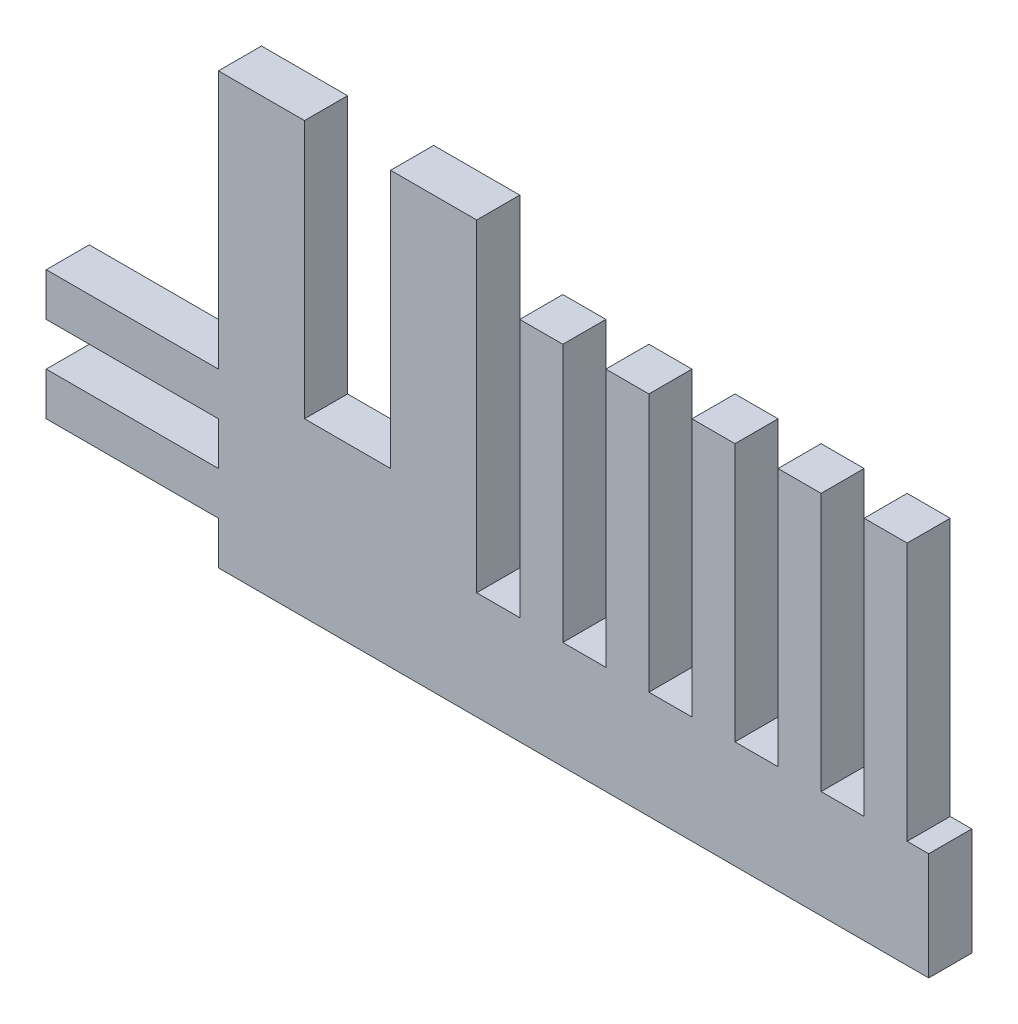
ISO-10303-21;
HEADER;
FILE_DESCRIPTION(('STEP AP214'),'2;1');
FILE_NAME('part.step','',(''),(''),'','','');
FILE_SCHEMA(('AUTOMOTIVE_DESIGN { 1 0 10303 214 1 1 1 1 }'));
ENDSEC;
DATA;
#1=APPLICATION_CONTEXT('core data for automotive mechanical design processes');
#2=APPLICATION_PROTOCOL_DEFINITION('international standard','automotive_design',2000,#1);
#3=PRODUCT_CONTEXT('',#1,'mechanical');
#4=PRODUCT('Part','Part','',(#3));
#5=PRODUCT_RELATED_PRODUCT_CATEGORY('part','',(#4));
#6=PRODUCT_DEFINITION_FORMATION('','',#4);
#7=PRODUCT_DEFINITION_CONTEXT('part definition',#1,'design');
#8=PRODUCT_DEFINITION('design','',#6,#7);
#9=PRODUCT_DEFINITION_SHAPE('','',#8);
#10=(LENGTH_UNIT() NAMED_UNIT(*) SI_UNIT(.MILLI.,.METRE.));
#11=(NAMED_UNIT(*) PLANE_ANGLE_UNIT() SI_UNIT($,.RADIAN.));
#12=(NAMED_UNIT(*) SI_UNIT($,.STERADIAN.) SOLID_ANGLE_UNIT());
#13=UNCERTAINTY_MEASURE_WITH_UNIT(LENGTH_MEASURE(1.E-05),#10,'distance_accuracy_value','');
#14=(GEOMETRIC_REPRESENTATION_CONTEXT(3) GLOBAL_UNCERTAINTY_ASSIGNED_CONTEXT((#13)) GLOBAL_UNIT_ASSIGNED_CONTEXT((#10,
#11,#12)) REPRESENTATION_CONTEXT('',''));
#15=CARTESIAN_POINT('',(0.,0.,0.));
#16=DIRECTION('',(0.,0.,1.));
#17=DIRECTION('',(1.,0.,0.));
#18=AXIS2_PLACEMENT_3D('',#15,#16,#17);
#19=CARTESIAN_POINT('',(16.5,0.,1.));
#20=DIRECTION('',(0.,1.,0.));
#21=DIRECTION('',(-1.,0.,0.));
#22=AXIS2_PLACEMENT_3D('',#19,#20,#21);
#23=PLANE('',#22);
#24=DIRECTION('',(1.,0.,0.));
#25=VECTOR('',#24,1.);
#26=CARTESIAN_POINT('',(16.5,0.,0.));
#27=LINE('',#26,#25);
#28=CARTESIAN_POINT('',(0.,0.,0.));
#29=VERTEX_POINT('',#28);
#30=CARTESIAN_POINT('',(16.5,0.,0.));
#31=VERTEX_POINT('',#30);
#32=EDGE_CURVE('E309',#29,#31,#27,.T.);
#33=ORIENTED_EDGE('',*,*,#32,.T.);
#34=DIRECTION('',(0.,0.,-1.));
#35=VECTOR('',#34,1.);
#36=CARTESIAN_POINT('',(16.5,0.,1.));
#37=LINE('',#36,#35);
#38=CARTESIAN_POINT('',(16.5,0.,1.));
#39=VERTEX_POINT('',#38);
#40=EDGE_CURVE('E11',#39,#31,#37,.T.);
#41=ORIENTED_EDGE('',*,*,#40,.F.);
#42=DIRECTION('',(1.,0.,0.));
#43=VECTOR('',#42,1.);
#44=CARTESIAN_POINT('',(16.5,0.,1.));
#45=LINE('',#44,#43);
#46=CARTESIAN_POINT('',(0.,0.,1.));
#47=VERTEX_POINT('',#46);
#48=EDGE_CURVE('E388',#47,#39,#45,.T.);
#49=ORIENTED_EDGE('',*,*,#48,.F.);
#50=DIRECTION('',(0.,0.,-1.));
#51=VECTOR('',#50,1.);
#52=CARTESIAN_POINT('',(0.,0.,1.));
#53=LINE('',#52,#51);
#54=EDGE_CURVE('E305',#47,#29,#53,.T.);
#55=ORIENTED_EDGE('',*,*,#54,.T.);
#56=EDGE_LOOP('',(#33,#41,#49,#55));
#57=FACE_BOUND('',#56,.T.);
#58=ADVANCED_FACE('F33',(#57),#23,.F.);
#59=CARTESIAN_POINT('',(16.5,0.,1.));
#60=DIRECTION('',(-1.,0.,0.));
#61=DIRECTION('',(0.,-1.,0.));
#62=AXIS2_PLACEMENT_3D('',#59,#60,#61);
#63=PLANE('',#62);
#64=DIRECTION('',(0.,1.,0.));
#65=VECTOR('',#64,1.);
#66=CARTESIAN_POINT('',(16.5,0.,0.));
#67=LINE('',#66,#65);
#68=CARTESIAN_POINT('',(16.5,2.5,0.));
#69=VERTEX_POINT('',#68);
#70=EDGE_CURVE('E312',#31,#69,#67,.T.);
#71=ORIENTED_EDGE('',*,*,#70,.T.);
#72=DIRECTION('',(0.,0.,-1.));
#73=VECTOR('',#72,1.);
#74=CARTESIAN_POINT('',(16.5,2.5,1.));
#75=LINE('',#74,#73);
#76=CARTESIAN_POINT('',(16.5,2.5,1.));
#77=VERTEX_POINT('',#76);
#78=EDGE_CURVE('E41',#77,#69,#75,.T.);
#79=ORIENTED_EDGE('',*,*,#78,.F.);
#80=DIRECTION('',(0.,1.,0.));
#81=VECTOR('',#80,1.);
#82=CARTESIAN_POINT('',(16.5,0.,1.));
#83=LINE('',#82,#81);
#84=EDGE_CURVE('E182',#39,#77,#83,.T.);
#85=ORIENTED_EDGE('',*,*,#84,.F.);
#86=ORIENTED_EDGE('',*,*,#40,.T.);
#87=EDGE_LOOP('',(#71,#79,#85,#86));
#88=FACE_BOUND('',#87,.T.);
#89=ADVANCED_FACE('F596',(#88),#63,.F.);
#90=CARTESIAN_POINT('',(16.,2.5,1.));
#91=DIRECTION('',(0.,-1.,0.));
#92=DIRECTION('',(0.,0.,-1.));
#93=AXIS2_PLACEMENT_3D('',#90,#91,#92);
#94=PLANE('',#93);
#95=DIRECTION('',(-1.,0.,0.));
#96=VECTOR('',#95,1.);
#97=CARTESIAN_POINT('',(16.,2.5,0.));
#98=LINE('',#97,#96);
#99=CARTESIAN_POINT('',(16.,2.5,0.));
#100=VERTEX_POINT('',#99);
#101=EDGE_CURVE('E314',#69,#100,#98,.T.);
#102=ORIENTED_EDGE('',*,*,#101,.T.);
#103=DIRECTION('',(0.,0.,-1.));
#104=VECTOR('',#103,1.);
#105=CARTESIAN_POINT('',(16.,2.5,1.));
#106=LINE('',#105,#104);
#107=CARTESIAN_POINT('',(16.,2.5,1.));
#108=VERTEX_POINT('',#107);
#109=EDGE_CURVE('E485',#108,#100,#106,.T.);
#110=ORIENTED_EDGE('',*,*,#109,.F.);
#111=DIRECTION('',(-1.,0.,0.));
#112=VECTOR('',#111,1.);
#113=CARTESIAN_POINT('',(16.,2.5,1.));
#114=LINE('',#113,#112);
#115=EDGE_CURVE('E493',#77,#108,#114,.T.);
#116=ORIENTED_EDGE('',*,*,#115,.F.);
#117=ORIENTED_EDGE('',*,*,#78,.T.);
#118=EDGE_LOOP('',(#102,#110,#116,#117));
#119=FACE_BOUND('',#118,.T.);
#120=ADVANCED_FACE('F491',(#119),#94,.F.);
#121=CARTESIAN_POINT('',(16.,8.5,1.));
#122=DIRECTION('',(-1.,0.,0.));
#123=DIRECTION('',(0.,-1.,0.));
#124=AXIS2_PLACEMENT_3D('',#121,#122,#123);
#125=PLANE('',#124);
#126=DIRECTION('',(0.,1.,0.));
#127=VECTOR('',#126,1.);
#128=CARTESIAN_POINT('',(16.,8.5,0.));
#129=LINE('',#128,#127);
#130=CARTESIAN_POINT('',(16.,8.5,0.));
#131=VERTEX_POINT('',#130);
#132=EDGE_CURVE('E316',#100,#131,#129,.T.);
#133=ORIENTED_EDGE('',*,*,#132,.T.);
#134=DIRECTION('',(0.,0.,-1.));
#135=VECTOR('',#134,1.);
#136=CARTESIAN_POINT('',(16.,8.5,1.));
#137=LINE('',#136,#135);
#138=CARTESIAN_POINT('',(16.,8.5,1.));
#139=VERTEX_POINT('',#138);
#140=EDGE_CURVE('E482',#139,#131,#137,.T.);
#141=ORIENTED_EDGE('',*,*,#140,.F.);
#142=DIRECTION('',(0.,1.,0.));
#143=VECTOR('',#142,1.);
#144=CARTESIAN_POINT('',(16.,8.5,1.));
#145=LINE('',#144,#143);
#146=EDGE_CURVE('E511',#108,#139,#145,.T.);
#147=ORIENTED_EDGE('',*,*,#146,.F.);
#148=ORIENTED_EDGE('',*,*,#109,.T.);
#149=EDGE_LOOP('',(#133,#141,#147,#148));
#150=FACE_BOUND('',#149,.T.);
#151=ADVANCED_FACE('F502',(#150),#125,.F.);
#152=CARTESIAN_POINT('',(15.,8.5,1.));
#153=DIRECTION('',(0.,-1.,0.));
#154=DIRECTION('',(0.,0.,-1.));
#155=AXIS2_PLACEMENT_3D('',#152,#153,#154);
#156=PLANE('',#155);
#157=DIRECTION('',(-1.,0.,0.));
#158=VECTOR('',#157,1.);
#159=CARTESIAN_POINT('',(15.,8.5,0.));
#160=LINE('',#159,#158);
#161=CARTESIAN_POINT('',(15.,8.5,0.));
#162=VERTEX_POINT('',#161);
#163=EDGE_CURVE('E318',#131,#162,#160,.T.);
#164=ORIENTED_EDGE('',*,*,#163,.T.);
#165=DIRECTION('',(0.,0.,-1.));
#166=VECTOR('',#165,1.);
#167=CARTESIAN_POINT('',(15.,8.5,1.));
#168=LINE('',#167,#166);
#169=CARTESIAN_POINT('',(15.,8.5,1.));
#170=VERTEX_POINT('',#169);
#171=EDGE_CURVE('E479',#170,#162,#168,.T.);
#172=ORIENTED_EDGE('',*,*,#171,.F.);
#173=DIRECTION('',(-1.,0.,0.));
#174=VECTOR('',#173,1.);
#175=CARTESIAN_POINT('',(15.,8.5,1.));
#176=LINE('',#175,#174);
#177=EDGE_CURVE('E508',#139,#170,#176,.T.);
#178=ORIENTED_EDGE('',*,*,#177,.F.);
#179=ORIENTED_EDGE('',*,*,#140,.T.);
#180=EDGE_LOOP('',(#164,#172,#178,#179));
#181=FACE_BOUND('',#180,.T.);
#182=ADVANCED_FACE('F506',(#181),#156,.F.);
#183=CARTESIAN_POINT('',(15.,2.5,1.));
#184=DIRECTION('',(1.,0.,0.));
#185=DIRECTION('',(0.,0.,-1.));
#186=AXIS2_PLACEMENT_3D('',#183,#184,#185);
#187=PLANE('',#186);
#188=DIRECTION('',(0.,-1.,0.));
#189=VECTOR('',#188,1.);
#190=CARTESIAN_POINT('',(15.,2.5,0.));
#191=LINE('',#190,#189);
#192=CARTESIAN_POINT('',(15.,2.5,0.));
#193=VERTEX_POINT('',#192);
#194=EDGE_CURVE('E320',#162,#193,#191,.T.);
#195=ORIENTED_EDGE('',*,*,#194,.T.);
#196=DIRECTION('',(0.,0.,-1.));
#197=VECTOR('',#196,1.);
#198=CARTESIAN_POINT('',(15.,2.5,1.));
#199=LINE('',#198,#197);
#200=CARTESIAN_POINT('',(15.,2.5,1.));
#201=VERTEX_POINT('',#200);
#202=EDGE_CURVE('E476',#201,#193,#199,.T.);
#203=ORIENTED_EDGE('',*,*,#202,.F.);
#204=DIRECTION('',(0.,-1.,0.));
#205=VECTOR('',#204,1.);
#206=CARTESIAN_POINT('',(15.,2.5,1.));
#207=LINE('',#206,#205);
#208=EDGE_CURVE('E510',#170,#201,#207,.T.);
#209=ORIENTED_EDGE('',*,*,#208,.F.);
#210=ORIENTED_EDGE('',*,*,#171,.T.);
#211=EDGE_LOOP('',(#195,#203,#209,#210));
#212=FACE_BOUND('',#211,.T.);
#213=ADVANCED_FACE('F609',(#212),#187,.F.);
#214=CARTESIAN_POINT('',(14.,2.5,1.));
#215=DIRECTION('',(0.,-1.,0.));
#216=DIRECTION('',(0.,0.,-1.));
#217=AXIS2_PLACEMENT_3D('',#214,#215,#216);
#218=PLANE('',#217);
#219=DIRECTION('',(-1.,0.,0.));
#220=VECTOR('',#219,1.);
#221=CARTESIAN_POINT('',(14.,2.5,0.));
#222=LINE('',#221,#220);
#223=CARTESIAN_POINT('',(14.,2.5,0.));
#224=VERTEX_POINT('',#223);
#225=EDGE_CURVE('E323',#193,#224,#222,.T.);
#226=ORIENTED_EDGE('',*,*,#225,.T.);
#227=DIRECTION('',(0.,0.,-1.));
#228=VECTOR('',#227,1.);
#229=CARTESIAN_POINT('',(14.,2.5,1.));
#230=LINE('',#229,#228);
#231=CARTESIAN_POINT('',(14.,2.5,1.));
#232=VERTEX_POINT('',#231);
#233=EDGE_CURVE('E473',#232,#224,#230,.T.);
#234=ORIENTED_EDGE('',*,*,#233,.F.);
#235=DIRECTION('',(-1.,0.,0.));
#236=VECTOR('',#235,1.);
#237=CARTESIAN_POINT('',(14.5,2.5,1.));
#238=LINE('',#237,#236);
#239=EDGE_CURVE('E513',#201,#232,#238,.T.);
#240=ORIENTED_EDGE('',*,*,#239,.F.);
#241=ORIENTED_EDGE('',*,*,#202,.T.);
#242=EDGE_LOOP('',(#226,#234,#240,#241));
#243=FACE_BOUND('',#242,.T.);
#244=ADVANCED_FACE('F612',(#243),#218,.F.);
#245=CARTESIAN_POINT('',(14.,8.5,1.));
#246=DIRECTION('',(-1.,0.,0.));
#247=DIRECTION('',(0.,-1.,0.));
#248=AXIS2_PLACEMENT_3D('',#245,#246,#247);
#249=PLANE('',#248);
#250=DIRECTION('',(0.,1.,0.));
#251=VECTOR('',#250,1.);
#252=CARTESIAN_POINT('',(14.,8.5,0.));
#253=LINE('',#252,#251);
#254=CARTESIAN_POINT('',(14.,8.5,0.));
#255=VERTEX_POINT('',#254);
#256=EDGE_CURVE('E325',#224,#255,#253,.T.);
#257=ORIENTED_EDGE('',*,*,#256,.T.);
#258=DIRECTION('',(0.,0.,-1.));
#259=VECTOR('',#258,1.);
#260=CARTESIAN_POINT('',(14.,8.5,1.));
#261=LINE('',#260,#259);
#262=CARTESIAN_POINT('',(14.,8.5,1.));
#263=VERTEX_POINT('',#262);
#264=EDGE_CURVE('E470',#263,#255,#261,.T.);
#265=ORIENTED_EDGE('',*,*,#264,.F.);
#266=DIRECTION('',(0.,1.,0.));
#267=VECTOR('',#266,1.);
#268=CARTESIAN_POINT('',(14.,8.5,1.));
#269=LINE('',#268,#267);
#270=EDGE_CURVE('E519',#232,#263,#269,.T.);
#271=ORIENTED_EDGE('',*,*,#270,.F.);
#272=ORIENTED_EDGE('',*,*,#233,.T.);
#273=EDGE_LOOP('',(#257,#265,#271,#272));
#274=FACE_BOUND('',#273,.T.);
#275=ADVANCED_FACE('F616',(#274),#249,.F.);
#276=CARTESIAN_POINT('',(13.,8.5,1.));
#277=DIRECTION('',(0.,-1.,0.));
#278=DIRECTION('',(0.,0.,-1.));
#279=AXIS2_PLACEMENT_3D('',#276,#277,#278);
#280=PLANE('',#279);
#281=DIRECTION('',(-1.,0.,0.));
#282=VECTOR('',#281,1.);
#283=CARTESIAN_POINT('',(13.,8.5,0.));
#284=LINE('',#283,#282);
#285=CARTESIAN_POINT('',(13.,8.5,0.));
#286=VERTEX_POINT('',#285);
#287=EDGE_CURVE('E327',#255,#286,#284,.T.);
#288=ORIENTED_EDGE('',*,*,#287,.T.);
#289=DIRECTION('',(0.,0.,-1.));
#290=VECTOR('',#289,1.);
#291=CARTESIAN_POINT('',(13.,8.5,1.));
#292=LINE('',#291,#290);
#293=CARTESIAN_POINT('',(13.,8.5,1.));
#294=VERTEX_POINT('',#293);
#295=EDGE_CURVE('E467',#294,#286,#292,.T.);
#296=ORIENTED_EDGE('',*,*,#295,.F.);
#297=DIRECTION('',(-1.,0.,0.));
#298=VECTOR('',#297,1.);
#299=CARTESIAN_POINT('',(13.,8.5,1.));
#300=LINE('',#299,#298);
#301=EDGE_CURVE('E521',#263,#294,#300,.T.);
#302=ORIENTED_EDGE('',*,*,#301,.F.);
#303=ORIENTED_EDGE('',*,*,#264,.T.);
#304=EDGE_LOOP('',(#288,#296,#302,#303));
#305=FACE_BOUND('',#304,.T.);
#306=ADVANCED_FACE('F620',(#305),#280,.F.);
#307=CARTESIAN_POINT('',(13.,2.5,1.));
#308=DIRECTION('',(1.,0.,0.));
#309=DIRECTION('',(0.,0.,-1.));
#310=AXIS2_PLACEMENT_3D('',#307,#308,#309);
#311=PLANE('',#310);
#312=DIRECTION('',(0.,-1.,0.));
#313=VECTOR('',#312,1.);
#314=CARTESIAN_POINT('',(13.,2.5,0.));
#315=LINE('',#314,#313);
#316=CARTESIAN_POINT('',(13.,2.5,0.));
#317=VERTEX_POINT('',#316);
#318=EDGE_CURVE('E329',#286,#317,#315,.T.);
#319=ORIENTED_EDGE('',*,*,#318,.T.);
#320=DIRECTION('',(0.,0.,-1.));
#321=VECTOR('',#320,1.);
#322=CARTESIAN_POINT('',(13.,2.5,1.));
#323=LINE('',#322,#321);
#324=CARTESIAN_POINT('',(13.,2.5,1.));
#325=VERTEX_POINT('',#324);
#326=EDGE_CURVE('E464',#325,#317,#323,.T.);
#327=ORIENTED_EDGE('',*,*,#326,.F.);
#328=DIRECTION('',(0.,-1.,0.));
#329=VECTOR('',#328,1.);
#330=CARTESIAN_POINT('',(13.,2.5,1.));
#331=LINE('',#330,#329);
#332=EDGE_CURVE('E523',#294,#325,#331,.T.);
#333=ORIENTED_EDGE('',*,*,#332,.F.);
#334=ORIENTED_EDGE('',*,*,#295,.T.);
#335=EDGE_LOOP('',(#319,#327,#333,#334));
#336=FACE_BOUND('',#335,.T.);
#337=ADVANCED_FACE('F624',(#336),#311,.F.);
#338=CARTESIAN_POINT('',(12.,2.5,1.));
#339=DIRECTION('',(0.,-1.,0.));
#340=DIRECTION('',(0.,0.,-1.));
#341=AXIS2_PLACEMENT_3D('',#338,#339,#340);
#342=PLANE('',#341);
#343=DIRECTION('',(-1.,0.,0.));
#344=VECTOR('',#343,1.);
#345=CARTESIAN_POINT('',(12.,2.5,0.));
#346=LINE('',#345,#344);
#347=CARTESIAN_POINT('',(12.,2.5,0.));
#348=VERTEX_POINT('',#347);
#349=EDGE_CURVE('E332',#317,#348,#346,.T.);
#350=ORIENTED_EDGE('',*,*,#349,.T.);
#351=DIRECTION('',(0.,0.,-1.));
#352=VECTOR('',#351,1.);
#353=CARTESIAN_POINT('',(12.,2.5,1.));
#354=LINE('',#353,#352);
#355=CARTESIAN_POINT('',(12.,2.5,1.));
#356=VERTEX_POINT('',#355);
#357=EDGE_CURVE('E461',#356,#348,#354,.T.);
#358=ORIENTED_EDGE('',*,*,#357,.F.);
#359=DIRECTION('',(-1.,0.,0.));
#360=VECTOR('',#359,1.);
#361=CARTESIAN_POINT('',(12.5,2.5,1.));
#362=LINE('',#361,#360);
#363=EDGE_CURVE('E525',#325,#356,#362,.T.);
#364=ORIENTED_EDGE('',*,*,#363,.F.);
#365=ORIENTED_EDGE('',*,*,#326,.T.);
#366=EDGE_LOOP('',(#350,#358,#364,#365));
#367=FACE_BOUND('',#366,.T.);
#368=ADVANCED_FACE('F628',(#367),#342,.F.);
#369=CARTESIAN_POINT('',(12.,8.5,1.));
#370=DIRECTION('',(-1.,0.,0.));
#371=DIRECTION('',(0.,-1.,0.));
#372=AXIS2_PLACEMENT_3D('',#369,#370,#371);
#373=PLANE('',#372);
#374=DIRECTION('',(0.,1.,0.));
#375=VECTOR('',#374,1.);
#376=CARTESIAN_POINT('',(12.,8.5,0.));
#377=LINE('',#376,#375);
#378=CARTESIAN_POINT('',(12.,8.5,0.));
#379=VERTEX_POINT('',#378);
#380=EDGE_CURVE('E334',#348,#379,#377,.T.);
#381=ORIENTED_EDGE('',*,*,#380,.T.);
#382=DIRECTION('',(0.,0.,-1.));
#383=VECTOR('',#382,1.);
#384=CARTESIAN_POINT('',(12.,8.5,1.));
#385=LINE('',#384,#383);
#386=CARTESIAN_POINT('',(12.,8.5,1.));
#387=VERTEX_POINT('',#386);
#388=EDGE_CURVE('E458',#387,#379,#385,.T.);
#389=ORIENTED_EDGE('',*,*,#388,.F.);
#390=DIRECTION('',(0.,1.,0.));
#391=VECTOR('',#390,1.);
#392=CARTESIAN_POINT('',(12.,8.5,1.));
#393=LINE('',#392,#391);
#394=EDGE_CURVE('E527',#356,#387,#393,.T.);
#395=ORIENTED_EDGE('',*,*,#394,.F.);
#396=ORIENTED_EDGE('',*,*,#357,.T.);
#397=EDGE_LOOP('',(#381,#389,#395,#396));
#398=FACE_BOUND('',#397,.T.);
#399=ADVANCED_FACE('F632',(#398),#373,.F.);
#400=CARTESIAN_POINT('',(11.,8.5,1.));
#401=DIRECTION('',(0.,-1.,0.));
#402=DIRECTION('',(0.,0.,-1.));
#403=AXIS2_PLACEMENT_3D('',#400,#401,#402);
#404=PLANE('',#403);
#405=DIRECTION('',(-1.,0.,0.));
#406=VECTOR('',#405,1.);
#407=CARTESIAN_POINT('',(11.,8.5,0.));
#408=LINE('',#407,#406);
#409=CARTESIAN_POINT('',(11.,8.5,0.));
#410=VERTEX_POINT('',#409);
#411=EDGE_CURVE('E336',#379,#410,#408,.T.);
#412=ORIENTED_EDGE('',*,*,#411,.T.);
#413=DIRECTION('',(0.,0.,-1.));
#414=VECTOR('',#413,1.);
#415=CARTESIAN_POINT('',(11.,8.5,1.));
#416=LINE('',#415,#414);
#417=CARTESIAN_POINT('',(11.,8.5,1.));
#418=VERTEX_POINT('',#417);
#419=EDGE_CURVE('E455',#418,#410,#416,.T.);
#420=ORIENTED_EDGE('',*,*,#419,.F.);
#421=DIRECTION('',(-1.,0.,0.));
#422=VECTOR('',#421,1.);
#423=CARTESIAN_POINT('',(11.,8.5,1.));
#424=LINE('',#423,#422);
#425=EDGE_CURVE('E529',#387,#418,#424,.T.);
#426=ORIENTED_EDGE('',*,*,#425,.F.);
#427=ORIENTED_EDGE('',*,*,#388,.T.);
#428=EDGE_LOOP('',(#412,#420,#426,#427));
#429=FACE_BOUND('',#428,.T.);
#430=ADVANCED_FACE('F636',(#429),#404,.F.);
#431=CARTESIAN_POINT('',(11.,2.5,1.));
#432=DIRECTION('',(1.,0.,0.));
#433=DIRECTION('',(0.,0.,-1.));
#434=AXIS2_PLACEMENT_3D('',#431,#432,#433);
#435=PLANE('',#434);
#436=DIRECTION('',(0.,-1.,0.));
#437=VECTOR('',#436,1.);
#438=CARTESIAN_POINT('',(11.,2.5,0.));
#439=LINE('',#438,#437);
#440=CARTESIAN_POINT('',(11.,2.5,0.));
#441=VERTEX_POINT('',#440);
#442=EDGE_CURVE('E338',#410,#441,#439,.T.);
#443=ORIENTED_EDGE('',*,*,#442,.T.);
#444=DIRECTION('',(0.,0.,-1.));
#445=VECTOR('',#444,1.);
#446=CARTESIAN_POINT('',(11.,2.5,1.));
#447=LINE('',#446,#445);
#448=CARTESIAN_POINT('',(11.,2.5,1.));
#449=VERTEX_POINT('',#448);
#450=EDGE_CURVE('E452',#449,#441,#447,.T.);
#451=ORIENTED_EDGE('',*,*,#450,.F.);
#452=DIRECTION('',(0.,-1.,0.));
#453=VECTOR('',#452,1.);
#454=CARTESIAN_POINT('',(11.,2.5,1.));
#455=LINE('',#454,#453);
#456=EDGE_CURVE('E531',#418,#449,#455,.T.);
#457=ORIENTED_EDGE('',*,*,#456,.F.);
#458=ORIENTED_EDGE('',*,*,#419,.T.);
#459=EDGE_LOOP('',(#443,#451,#457,#458));
#460=FACE_BOUND('',#459,.T.);
#461=ADVANCED_FACE('F640',(#460),#435,.F.);
#462=CARTESIAN_POINT('',(10.,2.5,1.));
#463=DIRECTION('',(0.,-1.,0.));
#464=DIRECTION('',(0.,0.,-1.));
#465=AXIS2_PLACEMENT_3D('',#462,#463,#464);
#466=PLANE('',#465);
#467=DIRECTION('',(-1.,0.,0.));
#468=VECTOR('',#467,1.);
#469=CARTESIAN_POINT('',(10.,2.5,0.));
#470=LINE('',#469,#468);
#471=CARTESIAN_POINT('',(10.,2.5,0.));
#472=VERTEX_POINT('',#471);
#473=EDGE_CURVE('E341',#441,#472,#470,.T.);
#474=ORIENTED_EDGE('',*,*,#473,.T.);
#475=DIRECTION('',(0.,0.,-1.));
#476=VECTOR('',#475,1.);
#477=CARTESIAN_POINT('',(10.,2.5,1.));
#478=LINE('',#477,#476);
#479=CARTESIAN_POINT('',(10.,2.5,1.));
#480=VERTEX_POINT('',#479);
#481=EDGE_CURVE('E449',#480,#472,#478,.T.);
#482=ORIENTED_EDGE('',*,*,#481,.F.);
#483=DIRECTION('',(-1.,0.,0.));
#484=VECTOR('',#483,1.);
#485=CARTESIAN_POINT('',(10.5,2.5,1.));
#486=LINE('',#485,#484);
#487=EDGE_CURVE('E533',#449,#480,#486,.T.);
#488=ORIENTED_EDGE('',*,*,#487,.F.);
#489=ORIENTED_EDGE('',*,*,#450,.T.);
#490=EDGE_LOOP('',(#474,#482,#488,#489));
#491=FACE_BOUND('',#490,.T.);
#492=ADVANCED_FACE('F644',(#491),#466,.F.);
#493=CARTESIAN_POINT('',(10.,8.5,1.));
#494=DIRECTION('',(-1.,0.,0.));
#495=DIRECTION('',(0.,-1.,0.));
#496=AXIS2_PLACEMENT_3D('',#493,#494,#495);
#497=PLANE('',#496);
#498=DIRECTION('',(0.,1.,0.));
#499=VECTOR('',#498,1.);
#500=CARTESIAN_POINT('',(10.,8.5,0.));
#501=LINE('',#500,#499);
#502=CARTESIAN_POINT('',(10.,8.5,0.));
#503=VERTEX_POINT('',#502);
#504=EDGE_CURVE('E343',#472,#503,#501,.T.);
#505=ORIENTED_EDGE('',*,*,#504,.T.);
#506=DIRECTION('',(0.,0.,-1.));
#507=VECTOR('',#506,1.);
#508=CARTESIAN_POINT('',(10.,8.5,1.));
#509=LINE('',#508,#507);
#510=CARTESIAN_POINT('',(10.,8.5,1.));
#511=VERTEX_POINT('',#510);
#512=EDGE_CURVE('E446',#511,#503,#509,.T.);
#513=ORIENTED_EDGE('',*,*,#512,.F.);
#514=DIRECTION('',(0.,1.,0.));
#515=VECTOR('',#514,1.);
#516=CARTESIAN_POINT('',(10.,8.5,1.));
#517=LINE('',#516,#515);
#518=EDGE_CURVE('E535',#480,#511,#517,.T.);
#519=ORIENTED_EDGE('',*,*,#518,.F.);
#520=ORIENTED_EDGE('',*,*,#481,.T.);
#521=EDGE_LOOP('',(#505,#513,#519,#520));
#522=FACE_BOUND('',#521,.T.);
#523=ADVANCED_FACE('F648',(#522),#497,.F.);
#524=CARTESIAN_POINT('',(9.,8.5,1.));
#525=DIRECTION('',(0.,-1.,0.));
#526=DIRECTION('',(0.,0.,-1.));
#527=AXIS2_PLACEMENT_3D('',#524,#525,#526);
#528=PLANE('',#527);
#529=DIRECTION('',(-1.,0.,0.));
#530=VECTOR('',#529,1.);
#531=CARTESIAN_POINT('',(9.,8.5,0.));
#532=LINE('',#531,#530);
#533=CARTESIAN_POINT('',(9.,8.5,0.));
#534=VERTEX_POINT('',#533);
#535=EDGE_CURVE('E345',#503,#534,#532,.T.);
#536=ORIENTED_EDGE('',*,*,#535,.T.);
#537=DIRECTION('',(0.,0.,-1.));
#538=VECTOR('',#537,1.);
#539=CARTESIAN_POINT('',(9.,8.5,1.));
#540=LINE('',#539,#538);
#541=CARTESIAN_POINT('',(9.,8.5,1.));
#542=VERTEX_POINT('',#541);
#543=EDGE_CURVE('E443',#542,#534,#540,.T.);
#544=ORIENTED_EDGE('',*,*,#543,.F.);
#545=DIRECTION('',(-1.,0.,0.));
#546=VECTOR('',#545,1.);
#547=CARTESIAN_POINT('',(9.,8.5,1.));
#548=LINE('',#547,#546);
#549=EDGE_CURVE('E537',#511,#542,#548,.T.);
#550=ORIENTED_EDGE('',*,*,#549,.F.);
#551=ORIENTED_EDGE('',*,*,#512,.T.);
#552=EDGE_LOOP('',(#536,#544,#550,#551));
#553=FACE_BOUND('',#552,.T.);
#554=ADVANCED_FACE('F652',(#553),#528,.F.);
#555=CARTESIAN_POINT('',(9.,2.5,1.));
#556=DIRECTION('',(1.,0.,0.));
#557=DIRECTION('',(0.,0.,-1.));
#558=AXIS2_PLACEMENT_3D('',#555,#556,#557);
#559=PLANE('',#558);
#560=DIRECTION('',(0.,-1.,0.));
#561=VECTOR('',#560,1.);
#562=CARTESIAN_POINT('',(9.,2.5,0.));
#563=LINE('',#562,#561);
#564=CARTESIAN_POINT('',(9.,2.5,0.));
#565=VERTEX_POINT('',#564);
#566=EDGE_CURVE('E347',#534,#565,#563,.T.);
#567=ORIENTED_EDGE('',*,*,#566,.T.);
#568=DIRECTION('',(0.,0.,-1.));
#569=VECTOR('',#568,1.);
#570=CARTESIAN_POINT('',(9.,2.5,1.));
#571=LINE('',#570,#569);
#572=CARTESIAN_POINT('',(9.,2.5,1.));
#573=VERTEX_POINT('',#572);
#574=EDGE_CURVE('E440',#573,#565,#571,.T.);
#575=ORIENTED_EDGE('',*,*,#574,.F.);
#576=DIRECTION('',(0.,-1.,0.));
#577=VECTOR('',#576,1.);
#578=CARTESIAN_POINT('',(9.,2.5,1.));
#579=LINE('',#578,#577);
#580=EDGE_CURVE('E539',#542,#573,#579,.T.);
#581=ORIENTED_EDGE('',*,*,#580,.F.);
#582=ORIENTED_EDGE('',*,*,#543,.T.);
#583=EDGE_LOOP('',(#567,#575,#581,#582));
#584=FACE_BOUND('',#583,.T.);
#585=ADVANCED_FACE('F656',(#584),#559,.F.);
#586=CARTESIAN_POINT('',(8.,2.5,1.));
#587=DIRECTION('',(0.,-1.,0.));
#588=DIRECTION('',(0.,0.,-1.));
#589=AXIS2_PLACEMENT_3D('',#586,#587,#588);
#590=PLANE('',#589);
#591=DIRECTION('',(-1.,0.,0.));
#592=VECTOR('',#591,1.);
#593=CARTESIAN_POINT('',(8.,2.5,0.));
#594=LINE('',#593,#592);
#595=CARTESIAN_POINT('',(8.,2.5,0.));
#596=VERTEX_POINT('',#595);
#597=EDGE_CURVE('E350',#565,#596,#594,.T.);
#598=ORIENTED_EDGE('',*,*,#597,.T.);
#599=DIRECTION('',(0.,0.,-1.));
#600=VECTOR('',#599,1.);
#601=CARTESIAN_POINT('',(8.,2.5,1.));
#602=LINE('',#601,#600);
#603=CARTESIAN_POINT('',(8.,2.5,1.));
#604=VERTEX_POINT('',#603);
#605=EDGE_CURVE('E437',#604,#596,#602,.T.);
#606=ORIENTED_EDGE('',*,*,#605,.F.);
#607=DIRECTION('',(-1.,0.,0.));
#608=VECTOR('',#607,1.);
#609=CARTESIAN_POINT('',(8.5,2.5,1.));
#610=LINE('',#609,#608);
#611=EDGE_CURVE('E541',#573,#604,#610,.T.);
#612=ORIENTED_EDGE('',*,*,#611,.F.);
#613=ORIENTED_EDGE('',*,*,#574,.T.);
#614=EDGE_LOOP('',(#598,#606,#612,#613));
#615=FACE_BOUND('',#614,.T.);
#616=ADVANCED_FACE('F660',(#615),#590,.F.);
#617=CARTESIAN_POINT('',(8.,8.5,1.));
#618=DIRECTION('',(-1.,0.,0.));
#619=DIRECTION('',(0.,-1.,0.));
#620=AXIS2_PLACEMENT_3D('',#617,#618,#619);
#621=PLANE('',#620);
#622=DIRECTION('',(0.,1.,0.));
#623=VECTOR('',#622,1.);
#624=CARTESIAN_POINT('',(8.,8.5,0.));
#625=LINE('',#624,#623);
#626=CARTESIAN_POINT('',(8.,8.5,0.));
#627=VERTEX_POINT('',#626);
#628=EDGE_CURVE('E352',#596,#627,#625,.T.);
#629=ORIENTED_EDGE('',*,*,#628,.T.);
#630=DIRECTION('',(0.,0.,-1.));
#631=VECTOR('',#630,1.);
#632=CARTESIAN_POINT('',(8.,8.5,1.));
#633=LINE('',#632,#631);
#634=CARTESIAN_POINT('',(8.,8.5,1.));
#635=VERTEX_POINT('',#634);
#636=EDGE_CURVE('E434',#635,#627,#633,.T.);
#637=ORIENTED_EDGE('',*,*,#636,.F.);
#638=DIRECTION('',(0.,1.,0.));
#639=VECTOR('',#638,1.);
#640=CARTESIAN_POINT('',(8.,8.5,1.));
#641=LINE('',#640,#639);
#642=EDGE_CURVE('E543',#604,#635,#641,.T.);
#643=ORIENTED_EDGE('',*,*,#642,.F.);
#644=ORIENTED_EDGE('',*,*,#605,.T.);
#645=EDGE_LOOP('',(#629,#637,#643,#644));
#646=FACE_BOUND('',#645,.T.);
#647=ADVANCED_FACE('F664',(#646),#621,.F.);
#648=CARTESIAN_POINT('',(7.,8.5,1.));
#649=DIRECTION('',(0.,-1.,0.));
#650=DIRECTION('',(0.,0.,-1.));
#651=AXIS2_PLACEMENT_3D('',#648,#649,#650);
#652=PLANE('',#651);
#653=DIRECTION('',(-1.,0.,0.));
#654=VECTOR('',#653,1.);
#655=CARTESIAN_POINT('',(7.,8.5,0.));
#656=LINE('',#655,#654);
#657=CARTESIAN_POINT('',(7.,8.5,0.));
#658=VERTEX_POINT('',#657);
#659=EDGE_CURVE('E354',#627,#658,#656,.T.);
#660=ORIENTED_EDGE('',*,*,#659,.T.);
#661=DIRECTION('',(0.,0.,-1.));
#662=VECTOR('',#661,1.);
#663=CARTESIAN_POINT('',(7.,8.5,1.));
#664=LINE('',#663,#662);
#665=CARTESIAN_POINT('',(7.,8.5,1.));
#666=VERTEX_POINT('',#665);
#667=EDGE_CURVE('E431',#666,#658,#664,.T.);
#668=ORIENTED_EDGE('',*,*,#667,.F.);
#669=DIRECTION('',(-1.,0.,0.));
#670=VECTOR('',#669,1.);
#671=CARTESIAN_POINT('',(7.,8.5,1.));
#672=LINE('',#671,#670);
#673=EDGE_CURVE('E545',#635,#666,#672,.T.);
#674=ORIENTED_EDGE('',*,*,#673,.F.);
#675=ORIENTED_EDGE('',*,*,#636,.T.);
#676=EDGE_LOOP('',(#660,#668,#674,#675));
#677=FACE_BOUND('',#676,.T.);
#678=ADVANCED_FACE('F668',(#677),#652,.F.);
#679=CARTESIAN_POINT('',(7.,2.5,1.));
#680=DIRECTION('',(1.,0.,0.));
#681=DIRECTION('',(0.,0.,-1.));
#682=AXIS2_PLACEMENT_3D('',#679,#680,#681);
#683=PLANE('',#682);
#684=DIRECTION('',(0.,-1.,0.));
#685=VECTOR('',#684,1.);
#686=CARTESIAN_POINT('',(7.,2.5,0.));
#687=LINE('',#686,#685);
#688=CARTESIAN_POINT('',(7.,2.5,0.));
#689=VERTEX_POINT('',#688);
#690=EDGE_CURVE('E356',#658,#689,#687,.T.);
#691=ORIENTED_EDGE('',*,*,#690,.T.);
#692=DIRECTION('',(0.,0.,-1.));
#693=VECTOR('',#692,1.);
#694=CARTESIAN_POINT('',(7.,2.5,1.));
#695=LINE('',#694,#693);
#696=CARTESIAN_POINT('',(7.,2.5,1.));
#697=VERTEX_POINT('',#696);
#698=EDGE_CURVE('E428',#697,#689,#695,.T.);
#699=ORIENTED_EDGE('',*,*,#698,.F.);
#700=DIRECTION('',(0.,-1.,0.));
#701=VECTOR('',#700,1.);
#702=CARTESIAN_POINT('',(7.,2.5,1.));
#703=LINE('',#702,#701);
#704=EDGE_CURVE('E547',#666,#697,#703,.T.);
#705=ORIENTED_EDGE('',*,*,#704,.F.);
#706=ORIENTED_EDGE('',*,*,#667,.T.);
#707=EDGE_LOOP('',(#691,#699,#705,#706));
#708=FACE_BOUND('',#707,.T.);
#709=ADVANCED_FACE('F672',(#708),#683,.F.);
#710=CARTESIAN_POINT('',(6.,2.5,1.));
#711=DIRECTION('',(0.,-1.,0.));
#712=DIRECTION('',(0.,0.,-1.));
#713=AXIS2_PLACEMENT_3D('',#710,#711,#712);
#714=PLANE('',#713);
#715=DIRECTION('',(-1.,0.,0.));
#716=VECTOR('',#715,1.);
#717=CARTESIAN_POINT('',(6.,2.5,0.));
#718=LINE('',#717,#716);
#719=CARTESIAN_POINT('',(6.,2.5,0.));
#720=VERTEX_POINT('',#719);
#721=EDGE_CURVE('E359',#689,#720,#718,.T.);
#722=ORIENTED_EDGE('',*,*,#721,.T.);
#723=DIRECTION('',(0.,0.,-1.));
#724=VECTOR('',#723,1.);
#725=CARTESIAN_POINT('',(6.,2.5,1.));
#726=LINE('',#725,#724);
#727=CARTESIAN_POINT('',(6.,2.5,1.));
#728=VERTEX_POINT('',#727);
#729=EDGE_CURVE('E425',#728,#720,#726,.T.);
#730=ORIENTED_EDGE('',*,*,#729,.F.);
#731=DIRECTION('',(-1.,0.,0.));
#732=VECTOR('',#731,1.);
#733=CARTESIAN_POINT('',(6.5,2.5,1.));
#734=LINE('',#733,#732);
#735=EDGE_CURVE('E549',#697,#728,#734,.T.);
#736=ORIENTED_EDGE('',*,*,#735,.F.);
#737=ORIENTED_EDGE('',*,*,#698,.T.);
#738=EDGE_LOOP('',(#722,#730,#736,#737));
#739=FACE_BOUND('',#738,.T.);
#740=ADVANCED_FACE('F676',(#739),#714,.F.);
#741=CARTESIAN_POINT('',(6.,10.,1.));
#742=DIRECTION('',(-1.,0.,0.));
#743=DIRECTION('',(0.,0.,1.));
#744=AXIS2_PLACEMENT_3D('',#741,#742,#743);
#745=PLANE('',#744);
#746=DIRECTION('',(0.,1.,0.));
#747=VECTOR('',#746,1.);
#748=CARTESIAN_POINT('',(6.,10.,0.));
#749=LINE('',#748,#747);
#750=CARTESIAN_POINT('',(6.,10.,0.));
#751=VERTEX_POINT('',#750);
#752=EDGE_CURVE('E361',#720,#751,#749,.T.);
#753=ORIENTED_EDGE('',*,*,#752,.T.);
#754=DIRECTION('',(0.,0.,-1.));
#755=VECTOR('',#754,1.);
#756=CARTESIAN_POINT('',(6.,10.,1.));
#757=LINE('',#756,#755);
#758=CARTESIAN_POINT('',(6.,10.,1.));
#759=VERTEX_POINT('',#758);
#760=EDGE_CURVE('E422',#759,#751,#757,.T.);
#761=ORIENTED_EDGE('',*,*,#760,.F.);
#762=DIRECTION('',(0.,1.,0.));
#763=VECTOR('',#762,1.);
#764=CARTESIAN_POINT('',(6.,10.,1.));
#765=LINE('',#764,#763);
#766=EDGE_CURVE('E551',#728,#759,#765,.T.);
#767=ORIENTED_EDGE('',*,*,#766,.F.);
#768=ORIENTED_EDGE('',*,*,#729,.T.);
#769=EDGE_LOOP('',(#753,#761,#767,#768));
#770=FACE_BOUND('',#769,.T.);
#771=ADVANCED_FACE('F680',(#770),#745,.F.);
#772=CARTESIAN_POINT('',(4.,10.,1.));
#773=DIRECTION('',(0.,-1.,0.));
#774=DIRECTION('',(0.,0.,-1.));
#775=AXIS2_PLACEMENT_3D('',#772,#773,#774);
#776=PLANE('',#775);
#777=DIRECTION('',(-1.,0.,0.));
#778=VECTOR('',#777,1.);
#779=CARTESIAN_POINT('',(4.,10.,0.));
#780=LINE('',#779,#778);
#781=CARTESIAN_POINT('',(4.,10.,0.));
#782=VERTEX_POINT('',#781);
#783=EDGE_CURVE('E363',#751,#782,#780,.T.);
#784=ORIENTED_EDGE('',*,*,#783,.T.);
#785=DIRECTION('',(0.,0.,-1.));
#786=VECTOR('',#785,1.);
#787=CARTESIAN_POINT('',(4.,10.,1.));
#788=LINE('',#787,#786);
#789=CARTESIAN_POINT('',(4.,10.,1.));
#790=VERTEX_POINT('',#789);
#791=EDGE_CURVE('E419',#790,#782,#788,.T.);
#792=ORIENTED_EDGE('',*,*,#791,.F.);
#793=DIRECTION('',(-1.,0.,0.));
#794=VECTOR('',#793,1.);
#795=CARTESIAN_POINT('',(4.,10.,1.));
#796=LINE('',#795,#794);
#797=EDGE_CURVE('E553',#759,#790,#796,.T.);
#798=ORIENTED_EDGE('',*,*,#797,.F.);
#799=ORIENTED_EDGE('',*,*,#760,.T.);
#800=EDGE_LOOP('',(#784,#792,#798,#799));
#801=FACE_BOUND('',#800,.T.);
#802=ADVANCED_FACE('F684',(#801),#776,.F.);
#803=CARTESIAN_POINT('',(4.,4.,1.));
#804=DIRECTION('',(1.,0.,0.));
#805=DIRECTION('',(0.,0.,-1.));
#806=AXIS2_PLACEMENT_3D('',#803,#804,#805);
#807=PLANE('',#806);
#808=DIRECTION('',(0.,-1.,0.));
#809=VECTOR('',#808,1.);
#810=CARTESIAN_POINT('',(4.,4.,0.));
#811=LINE('',#810,#809);
#812=CARTESIAN_POINT('',(4.,4.,0.));
#813=VERTEX_POINT('',#812);
#814=EDGE_CURVE('E365',#782,#813,#811,.T.);
#815=ORIENTED_EDGE('',*,*,#814,.T.);
#816=DIRECTION('',(0.,0.,-1.));
#817=VECTOR('',#816,1.);
#818=CARTESIAN_POINT('',(4.,4.,1.));
#819=LINE('',#818,#817);
#820=CARTESIAN_POINT('',(4.,4.,1.));
#821=VERTEX_POINT('',#820);
#822=EDGE_CURVE('E416',#821,#813,#819,.T.);
#823=ORIENTED_EDGE('',*,*,#822,.F.);
#824=DIRECTION('',(0.,-1.,0.));
#825=VECTOR('',#824,1.);
#826=CARTESIAN_POINT('',(4.,4.,1.));
#827=LINE('',#826,#825);
#828=EDGE_CURVE('E555',#790,#821,#827,.T.);
#829=ORIENTED_EDGE('',*,*,#828,.F.);
#830=ORIENTED_EDGE('',*,*,#791,.T.);
#831=EDGE_LOOP('',(#815,#823,#829,#830));
#832=FACE_BOUND('',#831,.T.);
#833=ADVANCED_FACE('F688',(#832),#807,.F.);
#834=CARTESIAN_POINT('',(2.,4.,1.));
#835=DIRECTION('',(0.,-1.,0.));
#836=DIRECTION('',(0.,0.,-1.));
#837=AXIS2_PLACEMENT_3D('',#834,#835,#836);
#838=PLANE('',#837);
#839=DIRECTION('',(-1.,0.,0.));
#840=VECTOR('',#839,1.);
#841=CARTESIAN_POINT('',(2.,4.,0.));
#842=LINE('',#841,#840);
#843=CARTESIAN_POINT('',(2.,4.,0.));
#844=VERTEX_POINT('',#843);
#845=EDGE_CURVE('E367',#813,#844,#842,.T.);
#846=ORIENTED_EDGE('',*,*,#845,.T.);
#847=DIRECTION('',(0.,0.,-1.));
#848=VECTOR('',#847,1.);
#849=CARTESIAN_POINT('',(2.,4.,1.));
#850=LINE('',#849,#848);
#851=CARTESIAN_POINT('',(2.,4.,1.));
#852=VERTEX_POINT('',#851);
#853=EDGE_CURVE('E413',#852,#844,#850,.T.);
#854=ORIENTED_EDGE('',*,*,#853,.F.);
#855=DIRECTION('',(-1.,0.,0.));
#856=VECTOR('',#855,1.);
#857=CARTESIAN_POINT('',(2.,4.,1.));
#858=LINE('',#857,#856);
#859=EDGE_CURVE('E557',#821,#852,#858,.T.);
#860=ORIENTED_EDGE('',*,*,#859,.F.);
#861=ORIENTED_EDGE('',*,*,#822,.T.);
#862=EDGE_LOOP('',(#846,#854,#860,#861));
#863=FACE_BOUND('',#862,.T.);
#864=ADVANCED_FACE('F692',(#863),#838,.F.);
#865=CARTESIAN_POINT('',(2.,10.,1.));
#866=DIRECTION('',(-1.,0.,0.));
#867=DIRECTION('',(0.,-1.,0.));
#868=AXIS2_PLACEMENT_3D('',#865,#866,#867);
#869=PLANE('',#868);
#870=DIRECTION('',(0.,1.,0.));
#871=VECTOR('',#870,1.);
#872=CARTESIAN_POINT('',(2.,10.,0.));
#873=LINE('',#872,#871);
#874=CARTESIAN_POINT('',(2.,10.,0.));
#875=VERTEX_POINT('',#874);
#876=EDGE_CURVE('E369',#844,#875,#873,.T.);
#877=ORIENTED_EDGE('',*,*,#876,.T.);
#878=DIRECTION('',(0.,0.,-1.));
#879=VECTOR('',#878,1.);
#880=CARTESIAN_POINT('',(2.,10.,1.));
#881=LINE('',#880,#879);
#882=CARTESIAN_POINT('',(2.,10.,1.));
#883=VERTEX_POINT('',#882);
#884=EDGE_CURVE('E410',#883,#875,#881,.T.);
#885=ORIENTED_EDGE('',*,*,#884,.F.);
#886=DIRECTION('',(0.,1.,0.));
#887=VECTOR('',#886,1.);
#888=CARTESIAN_POINT('',(2.,10.,1.));
#889=LINE('',#888,#887);
#890=EDGE_CURVE('E559',#852,#883,#889,.T.);
#891=ORIENTED_EDGE('',*,*,#890,.F.);
#892=ORIENTED_EDGE('',*,*,#853,.T.);
#893=EDGE_LOOP('',(#877,#885,#891,#892));
#894=FACE_BOUND('',#893,.T.);
#895=ADVANCED_FACE('F696',(#894),#869,.F.);
#896=CARTESIAN_POINT('',(0.,10.,1.));
#897=DIRECTION('',(0.,-1.,0.));
#898=DIRECTION('',(0.,0.,-1.));
#899=AXIS2_PLACEMENT_3D('',#896,#897,#898);
#900=PLANE('',#899);
#901=DIRECTION('',(-1.,0.,0.));
#902=VECTOR('',#901,1.);
#903=CARTESIAN_POINT('',(0.,10.,0.));
#904=LINE('',#903,#902);
#905=CARTESIAN_POINT('',(0.,10.,0.));
#906=VERTEX_POINT('',#905);
#907=EDGE_CURVE('E371',#875,#906,#904,.T.);
#908=ORIENTED_EDGE('',*,*,#907,.T.);
#909=DIRECTION('',(0.,0.,-1.));
#910=VECTOR('',#909,1.);
#911=CARTESIAN_POINT('',(0.,10.,1.));
#912=LINE('',#911,#910);
#913=CARTESIAN_POINT('',(0.,10.,1.));
#914=VERTEX_POINT('',#913);
#915=EDGE_CURVE('E407',#914,#906,#912,.T.);
#916=ORIENTED_EDGE('',*,*,#915,.F.);
#917=DIRECTION('',(-1.,0.,0.));
#918=VECTOR('',#917,1.);
#919=CARTESIAN_POINT('',(0.,10.,1.));
#920=LINE('',#919,#918);
#921=EDGE_CURVE('E561',#883,#914,#920,.T.);
#922=ORIENTED_EDGE('',*,*,#921,.F.);
#923=ORIENTED_EDGE('',*,*,#884,.T.);
#924=EDGE_LOOP('',(#908,#916,#922,#923));
#925=FACE_BOUND('',#924,.T.);
#926=ADVANCED_FACE('F700',(#925),#900,.F.);
#927=CARTESIAN_POINT('',(0.,4.,1.));
#928=DIRECTION('',(1.,0.,0.));
#929=DIRECTION('',(0.,0.,-1.));
#930=AXIS2_PLACEMENT_3D('',#927,#928,#929);
#931=PLANE('',#930);
#932=DIRECTION('',(0.,-1.,0.));
#933=VECTOR('',#932,1.);
#934=CARTESIAN_POINT('',(0.,4.,0.));
#935=LINE('',#934,#933);
#936=CARTESIAN_POINT('',(0.,4.,0.));
#937=VERTEX_POINT('',#936);
#938=EDGE_CURVE('E373',#906,#937,#935,.T.);
#939=ORIENTED_EDGE('',*,*,#938,.T.);
#940=DIRECTION('',(0.,0.,-1.));
#941=VECTOR('',#940,1.);
#942=CARTESIAN_POINT('',(0.,4.,1.));
#943=LINE('',#942,#941);
#944=CARTESIAN_POINT('',(0.,4.,1.));
#945=VERTEX_POINT('',#944);
#946=EDGE_CURVE('E404',#945,#937,#943,.T.);
#947=ORIENTED_EDGE('',*,*,#946,.F.);
#948=DIRECTION('',(0.,-1.,0.));
#949=VECTOR('',#948,1.);
#950=CARTESIAN_POINT('',(0.,4.,1.));
#951=LINE('',#950,#949);
#952=EDGE_CURVE('E563',#914,#945,#951,.T.);
#953=ORIENTED_EDGE('',*,*,#952,.F.);
#954=ORIENTED_EDGE('',*,*,#915,.T.);
#955=EDGE_LOOP('',(#939,#947,#953,#954));
#956=FACE_BOUND('',#955,.T.);
#957=ADVANCED_FACE('F704',(#956),#931,.F.);
#958=CARTESIAN_POINT('',(-4.,4.,1.));
#959=DIRECTION('',(0.,-1.,0.));
#960=DIRECTION('',(0.,0.,-1.));
#961=AXIS2_PLACEMENT_3D('',#958,#959,#960);
#962=PLANE('',#961);
#963=DIRECTION('',(-1.,0.,0.));
#964=VECTOR('',#963,1.);
#965=CARTESIAN_POINT('',(-4.,4.,0.));
#966=LINE('',#965,#964);
#967=CARTESIAN_POINT('',(-4.,4.,0.));
#968=VERTEX_POINT('',#967);
#969=EDGE_CURVE('E375',#937,#968,#966,.T.);
#970=ORIENTED_EDGE('',*,*,#969,.T.);
#971=DIRECTION('',(0.,0.,-1.));
#972=VECTOR('',#971,1.);
#973=CARTESIAN_POINT('',(-4.,4.,1.));
#974=LINE('',#973,#972);
#975=CARTESIAN_POINT('',(-4.,4.,1.));
#976=VERTEX_POINT('',#975);
#977=EDGE_CURVE('E401',#976,#968,#974,.T.);
#978=ORIENTED_EDGE('',*,*,#977,.F.);
#979=DIRECTION('',(-1.,0.,0.));
#980=VECTOR('',#979,1.);
#981=CARTESIAN_POINT('',(-4.,4.,1.));
#982=LINE('',#981,#980);
#983=EDGE_CURVE('E565',#945,#976,#982,.T.);
#984=ORIENTED_EDGE('',*,*,#983,.F.);
#985=ORIENTED_EDGE('',*,*,#946,.T.);
#986=EDGE_LOOP('',(#970,#978,#984,#985));
#987=FACE_BOUND('',#986,.T.);
#988=ADVANCED_FACE('F708',(#987),#962,.F.);
#989=CARTESIAN_POINT('',(-4.,3.,1.));
#990=DIRECTION('',(1.,0.,0.));
#991=DIRECTION('',(0.,0.,-1.));
#992=AXIS2_PLACEMENT_3D('',#989,#990,#991);
#993=PLANE('',#992);
#994=DIRECTION('',(0.,-1.,0.));
#995=VECTOR('',#994,1.);
#996=CARTESIAN_POINT('',(-4.,3.,0.));
#997=LINE('',#996,#995);
#998=CARTESIAN_POINT('',(-4.,3.,0.));
#999=VERTEX_POINT('',#998);
#1000=EDGE_CURVE('E377',#968,#999,#997,.T.);
#1001=ORIENTED_EDGE('',*,*,#1000,.T.);
#1002=DIRECTION('',(0.,0.,-1.));
#1003=VECTOR('',#1002,1.);
#1004=CARTESIAN_POINT('',(-4.,3.,1.));
#1005=LINE('',#1004,#1003);
#1006=CARTESIAN_POINT('',(-4.,3.,1.));
#1007=VERTEX_POINT('',#1006);
#1008=EDGE_CURVE('E398',#1007,#999,#1005,.T.);
#1009=ORIENTED_EDGE('',*,*,#1008,.F.);
#1010=DIRECTION('',(0.,-1.,0.));
#1011=VECTOR('',#1010,1.);
#1012=CARTESIAN_POINT('',(-4.,3.,1.));
#1013=LINE('',#1012,#1011);
#1014=EDGE_CURVE('E567',#976,#1007,#1013,.T.);
#1015=ORIENTED_EDGE('',*,*,#1014,.F.);
#1016=ORIENTED_EDGE('',*,*,#977,.T.);
#1017=EDGE_LOOP('',(#1001,#1009,#1015,#1016));
#1018=FACE_BOUND('',#1017,.T.);
#1019=ADVANCED_FACE('F712',(#1018),#993,.F.);
#1020=CARTESIAN_POINT('',(0.,3.,1.));
#1021=DIRECTION('',(0.,1.,0.));
#1022=DIRECTION('',(0.,0.,1.));
#1023=AXIS2_PLACEMENT_3D('',#1020,#1021,#1022);
#1024=PLANE('',#1023);
#1025=DIRECTION('',(1.,0.,0.));
#1026=VECTOR('',#1025,1.);
#1027=CARTESIAN_POINT('',(0.,3.,0.));
#1028=LINE('',#1027,#1026);
#1029=CARTESIAN_POINT('',(0.,3.,0.));
#1030=VERTEX_POINT('',#1029);
#1031=EDGE_CURVE('E379',#999,#1030,#1028,.T.);
#1032=ORIENTED_EDGE('',*,*,#1031,.T.);
#1033=DIRECTION('',(0.,0.,-1.));
#1034=VECTOR('',#1033,1.);
#1035=CARTESIAN_POINT('',(0.,3.,1.));
#1036=LINE('',#1035,#1034);
#1037=CARTESIAN_POINT('',(0.,3.,1.));
#1038=VERTEX_POINT('',#1037);
#1039=EDGE_CURVE('E395',#1038,#1030,#1036,.T.);
#1040=ORIENTED_EDGE('',*,*,#1039,.F.);
#1041=DIRECTION('',(1.,0.,0.));
#1042=VECTOR('',#1041,1.);
#1043=CARTESIAN_POINT('',(0.,3.,1.));
#1044=LINE('',#1043,#1042);
#1045=EDGE_CURVE('E569',#1007,#1038,#1044,.T.);
#1046=ORIENTED_EDGE('',*,*,#1045,.F.);
#1047=ORIENTED_EDGE('',*,*,#1008,.T.);
#1048=EDGE_LOOP('',(#1032,#1040,#1046,#1047));
#1049=FACE_BOUND('',#1048,.T.);
#1050=ADVANCED_FACE('F716',(#1049),#1024,.F.);
#1051=CARTESIAN_POINT('',(0.,2.,1.));
#1052=DIRECTION('',(1.,0.,0.));
#1053=DIRECTION('',(0.,0.,-1.));
#1054=AXIS2_PLACEMENT_3D('',#1051,#1052,#1053);
#1055=PLANE('',#1054);
#1056=DIRECTION('',(0.,-1.,0.));
#1057=VECTOR('',#1056,1.);
#1058=CARTESIAN_POINT('',(0.,2.,0.));
#1059=LINE('',#1058,#1057);
#1060=CARTESIAN_POINT('',(0.,2.,0.));
#1061=VERTEX_POINT('',#1060);
#1062=EDGE_CURVE('E381',#1030,#1061,#1059,.T.);
#1063=ORIENTED_EDGE('',*,*,#1062,.T.);
#1064=DIRECTION('',(0.,0.,-1.));
#1065=VECTOR('',#1064,1.);
#1066=CARTESIAN_POINT('',(0.,2.,1.));
#1067=LINE('',#1066,#1065);
#1068=CARTESIAN_POINT('',(0.,2.,1.));
#1069=VERTEX_POINT('',#1068);
#1070=EDGE_CURVE('E392',#1069,#1061,#1067,.T.);
#1071=ORIENTED_EDGE('',*,*,#1070,.F.);
#1072=DIRECTION('',(0.,-1.,0.));
#1073=VECTOR('',#1072,1.);
#1074=CARTESIAN_POINT('',(0.,2.,1.));
#1075=LINE('',#1074,#1073);
#1076=EDGE_CURVE('E571',#1038,#1069,#1075,.T.);
#1077=ORIENTED_EDGE('',*,*,#1076,.F.);
#1078=ORIENTED_EDGE('',*,*,#1039,.T.);
#1079=EDGE_LOOP('',(#1063,#1071,#1077,#1078));
#1080=FACE_BOUND('',#1079,.T.);
#1081=ADVANCED_FACE('F577',(#1080),#1055,.F.);
#1082=CARTESIAN_POINT('',(-4.,2.,1.));
#1083=DIRECTION('',(0.,-1.,0.));
#1084=DIRECTION('',(0.,0.,-1.));
#1085=AXIS2_PLACEMENT_3D('',#1082,#1083,#1084);
#1086=PLANE('',#1085);
#1087=DIRECTION('',(-1.,0.,0.));
#1088=VECTOR('',#1087,1.);
#1089=CARTESIAN_POINT('',(-4.,2.,0.));
#1090=LINE('',#1089,#1088);
#1091=CARTESIAN_POINT('',(-4.,2.,0.));
#1092=VERTEX_POINT('',#1091);
#1093=EDGE_CURVE('E383',#1061,#1092,#1090,.T.);
#1094=ORIENTED_EDGE('',*,*,#1093,.T.);
#1095=DIRECTION('',(0.,0.,-1.));
#1096=VECTOR('',#1095,1.);
#1097=CARTESIAN_POINT('',(-4.,2.,1.));
#1098=LINE('',#1097,#1096);
#1099=CARTESIAN_POINT('',(-4.,2.,1.));
#1100=VERTEX_POINT('',#1099);
#1101=EDGE_CURVE('E300',#1100,#1092,#1098,.T.);
#1102=ORIENTED_EDGE('',*,*,#1101,.F.);
#1103=DIRECTION('',(-1.,0.,0.));
#1104=VECTOR('',#1103,1.);
#1105=CARTESIAN_POINT('',(-4.,2.,1.));
#1106=LINE('',#1105,#1104);
#1107=EDGE_CURVE('E291',#1069,#1100,#1106,.T.);
#1108=ORIENTED_EDGE('',*,*,#1107,.F.);
#1109=ORIENTED_EDGE('',*,*,#1070,.T.);
#1110=EDGE_LOOP('',(#1094,#1102,#1108,#1109));
#1111=FACE_BOUND('',#1110,.T.);
#1112=ADVANCED_FACE('F581',(#1111),#1086,.F.);
#1113=CARTESIAN_POINT('',(-4.,1.,1.));
#1114=DIRECTION('',(1.,0.,0.));
#1115=DIRECTION('',(0.,0.,-1.));
#1116=AXIS2_PLACEMENT_3D('',#1113,#1114,#1115);
#1117=PLANE('',#1116);
#1118=DIRECTION('',(0.,-1.,0.));
#1119=VECTOR('',#1118,1.);
#1120=CARTESIAN_POINT('',(-4.,1.,0.));
#1121=LINE('',#1120,#1119);
#1122=CARTESIAN_POINT('',(-4.,1.,0.));
#1123=VERTEX_POINT('',#1122);
#1124=EDGE_CURVE('E299',#1092,#1123,#1121,.T.);
#1125=ORIENTED_EDGE('',*,*,#1124,.T.);
#1126=DIRECTION('',(0.,0.,-1.));
#1127=VECTOR('',#1126,1.);
#1128=CARTESIAN_POINT('',(-4.,1.,1.));
#1129=LINE('',#1128,#1127);
#1130=CARTESIAN_POINT('',(-4.,1.,1.));
#1131=VERTEX_POINT('',#1130);
#1132=EDGE_CURVE('E296',#1131,#1123,#1129,.T.);
#1133=ORIENTED_EDGE('',*,*,#1132,.F.);
#1134=DIRECTION('',(0.,-1.,0.));
#1135=VECTOR('',#1134,1.);
#1136=CARTESIAN_POINT('',(-4.,1.,1.));
#1137=LINE('',#1136,#1135);
#1138=EDGE_CURVE('E285',#1100,#1131,#1137,.T.);
#1139=ORIENTED_EDGE('',*,*,#1138,.F.);
#1140=ORIENTED_EDGE('',*,*,#1101,.T.);
#1141=EDGE_LOOP('',(#1125,#1133,#1139,#1140));
#1142=FACE_BOUND('',#1141,.T.);
#1143=ADVANCED_FACE('F297',(#1142),#1117,.F.);
#1144=CARTESIAN_POINT('',(0.,1.,1.));
#1145=DIRECTION('',(0.,1.,0.));
#1146=DIRECTION('',(-1.,0.,0.));
#1147=AXIS2_PLACEMENT_3D('',#1144,#1145,#1146);
#1148=PLANE('',#1147);
#1149=DIRECTION('',(1.,0.,0.));
#1150=VECTOR('',#1149,1.);
#1151=CARTESIAN_POINT('',(0.,1.,0.));
#1152=LINE('',#1151,#1150);
#1153=CARTESIAN_POINT('',(0.,1.,0.));
#1154=VERTEX_POINT('',#1153);
#1155=EDGE_CURVE('E168',#1123,#1154,#1152,.T.);
#1156=ORIENTED_EDGE('',*,*,#1155,.T.);
#1157=DIRECTION('',(0.,0.,-1.));
#1158=VECTOR('',#1157,1.);
#1159=CARTESIAN_POINT('',(0.,1.,1.));
#1160=LINE('',#1159,#1158);
#1161=CARTESIAN_POINT('',(0.,1.,1.));
#1162=VERTEX_POINT('',#1161);
#1163=EDGE_CURVE('E301',#1162,#1154,#1160,.T.);
#1164=ORIENTED_EDGE('',*,*,#1163,.F.);
#1165=DIRECTION('',(1.,0.,0.));
#1166=VECTOR('',#1165,1.);
#1167=CARTESIAN_POINT('',(0.,1.,1.));
#1168=LINE('',#1167,#1166);
#1169=EDGE_CURVE('E289',#1131,#1162,#1168,.T.);
#1170=ORIENTED_EDGE('',*,*,#1169,.F.);
#1171=ORIENTED_EDGE('',*,*,#1132,.T.);
#1172=EDGE_LOOP('',(#1156,#1164,#1170,#1171));
#1173=FACE_BOUND('',#1172,.T.);
#1174=ADVANCED_FACE('F303',(#1173),#1148,.F.);
#1175=CARTESIAN_POINT('',(0.,0.,1.));
#1176=DIRECTION('',(1.,0.,0.));
#1177=DIRECTION('',(0.,0.,-1.));
#1178=AXIS2_PLACEMENT_3D('',#1175,#1176,#1177);
#1179=PLANE('',#1178);
#1180=DIRECTION('',(0.,-1.,0.));
#1181=VECTOR('',#1180,1.);
#1182=CARTESIAN_POINT('',(0.,0.,0.));
#1183=LINE('',#1182,#1181);
#1184=EDGE_CURVE('E174',#1154,#29,#1183,.T.);
#1185=ORIENTED_EDGE('',*,*,#1184,.T.);
#1186=ORIENTED_EDGE('',*,*,#54,.F.);
#1187=DIRECTION('',(0.,-1.,0.));
#1188=VECTOR('',#1187,1.);
#1189=CARTESIAN_POINT('',(0.,0.,1.));
#1190=LINE('',#1189,#1188);
#1191=EDGE_CURVE('E49',#1162,#47,#1190,.T.);
#1192=ORIENTED_EDGE('',*,*,#1191,.F.);
#1193=ORIENTED_EDGE('',*,*,#1163,.T.);
#1194=EDGE_LOOP('',(#1185,#1186,#1192,#1193));
#1195=FACE_BOUND('',#1194,.T.);
#1196=ADVANCED_FACE('F585',(#1195),#1179,.F.);
#1197=CARTESIAN_POINT('',(0.,0.,1.));
#1198=DIRECTION('',(0.,0.,-1.));
#1199=DIRECTION('',(-1.,0.,0.));
#1200=AXIS2_PLACEMENT_3D('',#1197,#1198,#1199);
#1201=PLANE('',#1200);
#1202=ORIENTED_EDGE('',*,*,#48,.T.);
#1203=ORIENTED_EDGE('',*,*,#84,.T.);
#1204=ORIENTED_EDGE('',*,*,#115,.T.);
#1205=ORIENTED_EDGE('',*,*,#146,.T.);
#1206=ORIENTED_EDGE('',*,*,#177,.T.);
#1207=ORIENTED_EDGE('',*,*,#208,.T.);
#1208=ORIENTED_EDGE('',*,*,#239,.T.);
#1209=ORIENTED_EDGE('',*,*,#270,.T.);
#1210=ORIENTED_EDGE('',*,*,#301,.T.);
#1211=ORIENTED_EDGE('',*,*,#332,.T.);
#1212=ORIENTED_EDGE('',*,*,#363,.T.);
#1213=ORIENTED_EDGE('',*,*,#394,.T.);
#1214=ORIENTED_EDGE('',*,*,#425,.T.);
#1215=ORIENTED_EDGE('',*,*,#456,.T.);
#1216=ORIENTED_EDGE('',*,*,#487,.T.);
#1217=ORIENTED_EDGE('',*,*,#518,.T.);
#1218=ORIENTED_EDGE('',*,*,#549,.T.);
#1219=ORIENTED_EDGE('',*,*,#580,.T.);
#1220=ORIENTED_EDGE('',*,*,#611,.T.);
#1221=ORIENTED_EDGE('',*,*,#642,.T.);
#1222=ORIENTED_EDGE('',*,*,#673,.T.);
#1223=ORIENTED_EDGE('',*,*,#704,.T.);
#1224=ORIENTED_EDGE('',*,*,#735,.T.);
#1225=ORIENTED_EDGE('',*,*,#766,.T.);
#1226=ORIENTED_EDGE('',*,*,#797,.T.);
#1227=ORIENTED_EDGE('',*,*,#828,.T.);
#1228=ORIENTED_EDGE('',*,*,#859,.T.);
#1229=ORIENTED_EDGE('',*,*,#890,.T.);
#1230=ORIENTED_EDGE('',*,*,#921,.T.);
#1231=ORIENTED_EDGE('',*,*,#952,.T.);
#1232=ORIENTED_EDGE('',*,*,#983,.T.);
#1233=ORIENTED_EDGE('',*,*,#1014,.T.);
#1234=ORIENTED_EDGE('',*,*,#1045,.T.);
#1235=ORIENTED_EDGE('',*,*,#1076,.T.);
#1236=ORIENTED_EDGE('',*,*,#1107,.T.);
#1237=ORIENTED_EDGE('',*,*,#1138,.T.);
#1238=ORIENTED_EDGE('',*,*,#1169,.T.);
#1239=ORIENTED_EDGE('',*,*,#1191,.T.);
#1240=EDGE_LOOP('',(#1202,#1203,#1204,#1205,#1206,#1207,#1208,#1209,#1210,#1211,#1212,#1213,
#1214,#1215,#1216,#1217,#1218,#1219,#1220,#1221,#1222,#1223,#1224,#1225,#1226,#1227,#1228,#1229,
#1230,#1231,#1232,#1233,#1234,#1235,#1236,#1237,#1238,#1239));
#1241=FACE_BOUND('',#1240,.T.);
#1242=ADVANCED_FACE('F287',(#1241),#1201,.F.);
#1243=CARTESIAN_POINT('',(0.,0.,0.));
#1244=DIRECTION('',(0.,0.,-1.));
#1245=DIRECTION('',(-1.,0.,0.));
#1246=AXIS2_PLACEMENT_3D('',#1243,#1244,#1245);
#1247=PLANE('',#1246);
#1248=ORIENTED_EDGE('',*,*,#32,.F.);
#1249=ORIENTED_EDGE('',*,*,#1184,.F.);
#1250=ORIENTED_EDGE('',*,*,#1155,.F.);
#1251=ORIENTED_EDGE('',*,*,#1124,.F.);
#1252=ORIENTED_EDGE('',*,*,#1093,.F.);
#1253=ORIENTED_EDGE('',*,*,#1062,.F.);
#1254=ORIENTED_EDGE('',*,*,#1031,.F.);
#1255=ORIENTED_EDGE('',*,*,#1000,.F.);
#1256=ORIENTED_EDGE('',*,*,#969,.F.);
#1257=ORIENTED_EDGE('',*,*,#938,.F.);
#1258=ORIENTED_EDGE('',*,*,#907,.F.);
#1259=ORIENTED_EDGE('',*,*,#876,.F.);
#1260=ORIENTED_EDGE('',*,*,#845,.F.);
#1261=ORIENTED_EDGE('',*,*,#814,.F.);
#1262=ORIENTED_EDGE('',*,*,#783,.F.);
#1263=ORIENTED_EDGE('',*,*,#752,.F.);
#1264=ORIENTED_EDGE('',*,*,#721,.F.);
#1265=ORIENTED_EDGE('',*,*,#690,.F.);
#1266=ORIENTED_EDGE('',*,*,#659,.F.);
#1267=ORIENTED_EDGE('',*,*,#628,.F.);
#1268=ORIENTED_EDGE('',*,*,#597,.F.);
#1269=ORIENTED_EDGE('',*,*,#566,.F.);
#1270=ORIENTED_EDGE('',*,*,#535,.F.);
#1271=ORIENTED_EDGE('',*,*,#504,.F.);
#1272=ORIENTED_EDGE('',*,*,#473,.F.);
#1273=ORIENTED_EDGE('',*,*,#442,.F.);
#1274=ORIENTED_EDGE('',*,*,#411,.F.);
#1275=ORIENTED_EDGE('',*,*,#380,.F.);
#1276=ORIENTED_EDGE('',*,*,#349,.F.);
#1277=ORIENTED_EDGE('',*,*,#318,.F.);
#1278=ORIENTED_EDGE('',*,*,#287,.F.);
#1279=ORIENTED_EDGE('',*,*,#256,.F.);
#1280=ORIENTED_EDGE('',*,*,#225,.F.);
#1281=ORIENTED_EDGE('',*,*,#194,.F.);
#1282=ORIENTED_EDGE('',*,*,#163,.F.);
#1283=ORIENTED_EDGE('',*,*,#132,.F.);
#1284=ORIENTED_EDGE('',*,*,#101,.F.);
#1285=ORIENTED_EDGE('',*,*,#70,.F.);
#1286=EDGE_LOOP('',(#1248,#1249,#1250,#1251,#1252,#1253,#1254,#1255,#1256,#1257,#1258,#1259,
#1260,#1261,#1262,#1263,#1264,#1265,#1266,#1267,#1268,#1269,#1270,#1271,#1272,#1273,#1274,#1275,
#1276,#1277,#1278,#1279,#1280,#1281,#1282,#1283,#1284,#1285));
#1287=FACE_BOUND('',#1286,.T.);
#1288=ADVANCED_FACE('F497',(#1287),#1247,.T.);
#1289=CLOSED_SHELL('',(#58,#89,#120,#151,#182,#213,#244,#275,#306,#337,#368,#399,#430,#461,#492,
#523,#554,#585,#616,#647,#678,#709,#740,#771,#802,#833,#864,#895,#926,#957,#988,#1019,#1050,
#1081,#1112,#1143,#1174,#1196,#1242,#1288));
#1290=MANIFOLD_SOLID_BREP('B2',#1289);
#1291=ADVANCED_BREP_SHAPE_REPRESENTATION('',(#18,#1290),#14);
#1292=SHAPE_DEFINITION_REPRESENTATION(#9,#1291);
ENDSEC;
END-ISO-10303-21;
